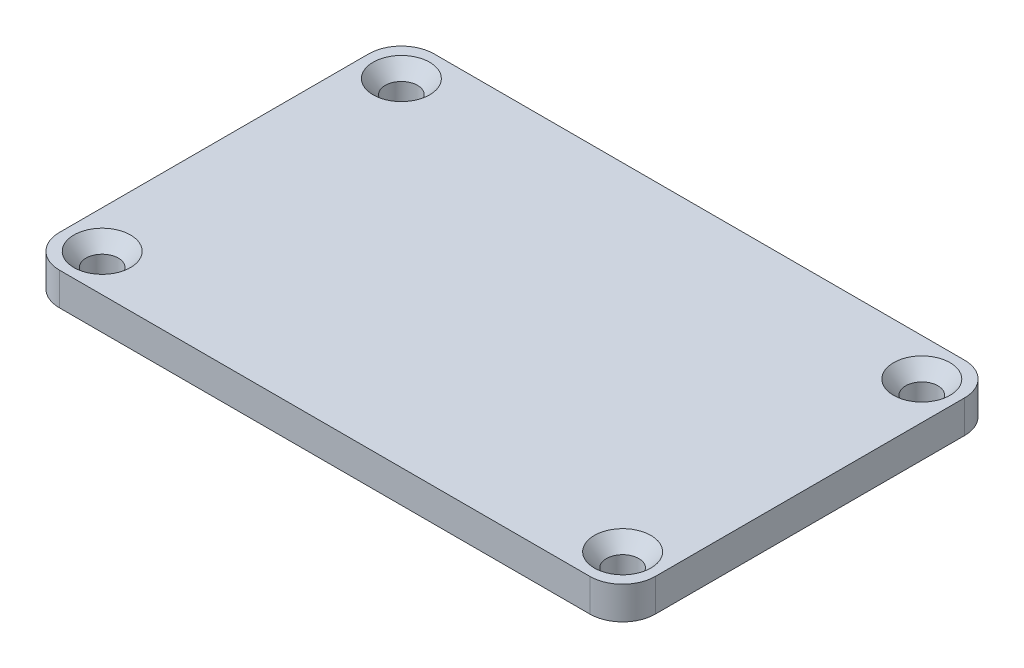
ISO-10303-21;
HEADER;
FILE_DESCRIPTION(('STEP AP214'),'2;1');
FILE_NAME('part.step','',(''),(''),'','','');
FILE_SCHEMA(('AUTOMOTIVE_DESIGN { 1 0 10303 214 1 1 1 1 }'));
ENDSEC;
DATA;
#1=APPLICATION_CONTEXT('core data for automotive mechanical design processes');
#2=APPLICATION_PROTOCOL_DEFINITION('international standard','automotive_design',2000,#1);
#3=PRODUCT_CONTEXT('',#1,'mechanical');
#4=PRODUCT('Part','Part','',(#3));
#5=PRODUCT_RELATED_PRODUCT_CATEGORY('part','',(#4));
#6=PRODUCT_DEFINITION_FORMATION('','',#4);
#7=PRODUCT_DEFINITION_CONTEXT('part definition',#1,'design');
#8=PRODUCT_DEFINITION('design','',#6,#7);
#9=PRODUCT_DEFINITION_SHAPE('','',#8);
#10=(LENGTH_UNIT() NAMED_UNIT(*) SI_UNIT(.MILLI.,.METRE.));
#11=(NAMED_UNIT(*) PLANE_ANGLE_UNIT() SI_UNIT($,.RADIAN.));
#12=(NAMED_UNIT(*) SI_UNIT($,.STERADIAN.) SOLID_ANGLE_UNIT());
#13=UNCERTAINTY_MEASURE_WITH_UNIT(LENGTH_MEASURE(1.E-05),#10,'distance_accuracy_value','');
#14=(GEOMETRIC_REPRESENTATION_CONTEXT(3) GLOBAL_UNCERTAINTY_ASSIGNED_CONTEXT((#13)) GLOBAL_UNIT_ASSIGNED_CONTEXT((#10,
#11,#12)) REPRESENTATION_CONTEXT('',''));
#15=CARTESIAN_POINT('',(0.,0.,0.));
#16=DIRECTION('',(0.,0.,1.));
#17=DIRECTION('',(1.,0.,0.));
#18=AXIS2_PLACEMENT_3D('',#15,#16,#17);
#19=CARTESIAN_POINT('',(-30.099,3.302,-18.923));
#20=DIRECTION('',(0.,0.,-1.));
#21=DIRECTION('',(-1.,0.,0.));
#22=AXIS2_PLACEMENT_3D('',#19,#20,#21);
#23=PLANE('',#22);
#24=DIRECTION('',(1.,0.,0.));
#25=VECTOR('',#24,1.);
#26=CARTESIAN_POINT('',(-30.099,0.,-18.923));
#27=LINE('',#26,#25);
#28=CARTESIAN_POINT('',(-26.797,0.,-18.923));
#29=VERTEX_POINT('',#28);
#30=CARTESIAN_POINT('',(26.797,0.,-18.923));
#31=VERTEX_POINT('',#30);
#32=EDGE_CURVE('E185',#29,#31,#27,.T.);
#33=ORIENTED_EDGE('',*,*,#32,.F.);
#34=DIRECTION('',(0.,-1.,0.));
#35=VECTOR('',#34,1.);
#36=CARTESIAN_POINT('',(-26.797,3.302,-18.923));
#37=LINE('',#36,#35);
#38=CARTESIAN_POINT('',(-26.797,3.302,-18.923));
#39=VERTEX_POINT('',#38);
#40=EDGE_CURVE('E155',#29,#39,#37,.F.);
#41=ORIENTED_EDGE('',*,*,#40,.T.);
#42=DIRECTION('',(1.,0.,0.));
#43=VECTOR('',#42,1.);
#44=CARTESIAN_POINT('',(-30.099,3.302,-18.923));
#45=LINE('',#44,#43);
#46=CARTESIAN_POINT('',(26.797,3.302,-18.923));
#47=VERTEX_POINT('',#46);
#48=EDGE_CURVE('E129',#39,#47,#45,.T.);
#49=ORIENTED_EDGE('',*,*,#48,.T.);
#50=DIRECTION('',(0.,-1.,0.));
#51=VECTOR('',#50,1.);
#52=CARTESIAN_POINT('',(26.797,0.,-18.923));
#53=LINE('',#52,#51);
#54=EDGE_CURVE('E151',#47,#31,#53,.T.);
#55=ORIENTED_EDGE('',*,*,#54,.T.);
#56=EDGE_LOOP('',(#33,#41,#49,#55));
#57=FACE_BOUND('',#56,.T.);
#58=ADVANCED_FACE('F39',(#57),#23,.T.);
#59=CARTESIAN_POINT('',(-30.099,3.302,18.923));
#60=DIRECTION('',(-1.,0.,0.));
#61=DIRECTION('',(0.,0.,1.));
#62=AXIS2_PLACEMENT_3D('',#59,#60,#61);
#63=PLANE('',#62);
#64=DIRECTION('',(0.,0.,-1.));
#65=VECTOR('',#64,1.);
#66=CARTESIAN_POINT('',(-30.099,3.302,18.923));
#67=LINE('',#66,#65);
#68=CARTESIAN_POINT('',(-30.099,3.302,15.621));
#69=VERTEX_POINT('',#68);
#70=CARTESIAN_POINT('',(-30.099,3.302,-15.621));
#71=VERTEX_POINT('',#70);
#72=EDGE_CURVE('E135',#69,#71,#67,.T.);
#73=ORIENTED_EDGE('',*,*,#72,.T.);
#74=DIRECTION('',(0.,-1.,0.));
#75=VECTOR('',#74,1.);
#76=CARTESIAN_POINT('',(-30.099,3.302,-15.621));
#77=LINE('',#76,#75);
#78=CARTESIAN_POINT('',(-30.099,0.,-15.621));
#79=VERTEX_POINT('',#78);
#80=EDGE_CURVE('E127',#71,#79,#77,.T.);
#81=ORIENTED_EDGE('',*,*,#80,.T.);
#82=DIRECTION('',(0.,0.,-1.));
#83=VECTOR('',#82,1.);
#84=CARTESIAN_POINT('',(-30.099,0.,18.923));
#85=LINE('',#84,#83);
#86=CARTESIAN_POINT('',(-30.099,0.,15.621));
#87=VERTEX_POINT('',#86);
#88=EDGE_CURVE('E109',#87,#79,#85,.T.);
#89=ORIENTED_EDGE('',*,*,#88,.F.);
#90=DIRECTION('',(0.,-1.,0.));
#91=VECTOR('',#90,1.);
#92=CARTESIAN_POINT('',(-30.099,3.302,15.621));
#93=LINE('',#92,#91);
#94=EDGE_CURVE('E124',#87,#69,#93,.F.);
#95=ORIENTED_EDGE('',*,*,#94,.T.);
#96=EDGE_LOOP('',(#73,#81,#89,#95));
#97=FACE_BOUND('',#96,.T.);
#98=ADVANCED_FACE('F123',(#97),#63,.T.);
#99=CARTESIAN_POINT('',(-30.099,3.302,18.923));
#100=DIRECTION('',(0.,0.,-1.));
#101=DIRECTION('',(-1.,0.,0.));
#102=AXIS2_PLACEMENT_3D('',#99,#100,#101);
#103=PLANE('',#102);
#104=DIRECTION('',(1.,0.,0.));
#105=VECTOR('',#104,1.);
#106=CARTESIAN_POINT('',(-30.099,3.302,18.923));
#107=LINE('',#106,#105);
#108=CARTESIAN_POINT('',(-26.797,3.302,18.923));
#109=VERTEX_POINT('',#108);
#110=CARTESIAN_POINT('',(26.797,3.302,18.923));
#111=VERTEX_POINT('',#110);
#112=EDGE_CURVE('E141',#109,#111,#107,.T.);
#113=ORIENTED_EDGE('',*,*,#112,.F.);
#114=DIRECTION('',(0.,-1.,0.));
#115=VECTOR('',#114,1.);
#116=CARTESIAN_POINT('',(-26.797,0.,18.923));
#117=LINE('',#116,#115);
#118=CARTESIAN_POINT('',(-26.797,0.,18.923));
#119=VERTEX_POINT('',#118);
#120=EDGE_CURVE('E171',#109,#119,#117,.T.);
#121=ORIENTED_EDGE('',*,*,#120,.T.);
#122=DIRECTION('',(1.,0.,0.));
#123=VECTOR('',#122,1.);
#124=CARTESIAN_POINT('',(-30.099,0.,18.923));
#125=LINE('',#124,#123);
#126=CARTESIAN_POINT('',(26.797,0.,18.923));
#127=VERTEX_POINT('',#126);
#128=EDGE_CURVE('E111',#119,#127,#125,.T.);
#129=ORIENTED_EDGE('',*,*,#128,.T.);
#130=DIRECTION('',(0.,-1.,0.));
#131=VECTOR('',#130,1.);
#132=CARTESIAN_POINT('',(26.797,3.302,18.923));
#133=LINE('',#132,#131);
#134=EDGE_CURVE('E168',#127,#111,#133,.F.);
#135=ORIENTED_EDGE('',*,*,#134,.T.);
#136=EDGE_LOOP('',(#113,#121,#129,#135));
#137=FACE_BOUND('',#136,.T.);
#138=ADVANCED_FACE('F176',(#137),#103,.F.);
#139=CARTESIAN_POINT('',(30.099,3.302,18.923));
#140=DIRECTION('',(-1.,0.,0.));
#141=DIRECTION('',(0.,0.,1.));
#142=AXIS2_PLACEMENT_3D('',#139,#140,#141);
#143=PLANE('',#142);
#144=DIRECTION('',(0.,0.,-1.));
#145=VECTOR('',#144,1.);
#146=CARTESIAN_POINT('',(30.099,3.302,18.923));
#147=LINE('',#146,#145);
#148=CARTESIAN_POINT('',(30.099,3.302,15.621));
#149=VERTEX_POINT('',#148);
#150=CARTESIAN_POINT('',(30.099,3.302,-15.621));
#151=VERTEX_POINT('',#150);
#152=EDGE_CURVE('E179',#149,#151,#147,.T.);
#153=ORIENTED_EDGE('',*,*,#152,.F.);
#154=DIRECTION('',(0.,-1.,0.));
#155=VECTOR('',#154,1.);
#156=CARTESIAN_POINT('',(30.099,3.302,15.621));
#157=LINE('',#156,#155);
#158=CARTESIAN_POINT('',(30.099,0.,15.621));
#159=VERTEX_POINT('',#158);
#160=EDGE_CURVE('E11',#149,#159,#157,.T.);
#161=ORIENTED_EDGE('',*,*,#160,.T.);
#162=DIRECTION('',(0.,0.,-1.));
#163=VECTOR('',#162,1.);
#164=CARTESIAN_POINT('',(30.099,0.,18.923));
#165=LINE('',#164,#163);
#166=CARTESIAN_POINT('',(30.099,0.,-15.621));
#167=VERTEX_POINT('',#166);
#168=EDGE_CURVE('E189',#159,#167,#165,.T.);
#169=ORIENTED_EDGE('',*,*,#168,.T.);
#170=DIRECTION('',(0.,-1.,0.));
#171=VECTOR('',#170,1.);
#172=CARTESIAN_POINT('',(30.099,3.302,-15.621));
#173=LINE('',#172,#171);
#174=EDGE_CURVE('E48',#167,#151,#173,.F.);
#175=ORIENTED_EDGE('',*,*,#174,.T.);
#176=EDGE_LOOP('',(#153,#161,#169,#175));
#177=FACE_BOUND('',#176,.T.);
#178=ADVANCED_FACE('F253',(#177),#143,.F.);
#179=CARTESIAN_POINT('',(0.,3.302,0.));
#180=DIRECTION('',(0.,1.,0.));
#181=DIRECTION('',(0.,0.,1.));
#182=AXIS2_PLACEMENT_3D('',#179,#180,#181);
#183=PLANE('',#182);
#184=CARTESIAN_POINT('',(-26.289,3.302,-15.113));
#185=DIRECTION('',(0.,1.,0.));
#186=DIRECTION('',(0.,0.,1.));
#187=AXIS2_PLACEMENT_3D('',#184,#185,#186);
#188=CIRCLE('',#187,2.8575);
#189=CARTESIAN_POINT('',(-26.289,3.302,-12.2555));
#190=VERTEX_POINT('',#189);
#191=EDGE_CURVE('E237',#190,#190,#188,.T.);
#192=ORIENTED_EDGE('',*,*,#191,.F.);
#193=EDGE_LOOP('',(#192));
#194=FACE_BOUND('',#193,.T.);
#195=CARTESIAN_POINT('',(26.289,3.302,-15.113));
#196=DIRECTION('',(0.,1.,0.));
#197=DIRECTION('',(0.,0.,1.));
#198=AXIS2_PLACEMENT_3D('',#195,#196,#197);
#199=CIRCLE('',#198,2.8575);
#200=CARTESIAN_POINT('',(26.289,3.302,-12.2555));
#201=VERTEX_POINT('',#200);
#202=EDGE_CURVE('E225',#201,#201,#199,.T.);
#203=ORIENTED_EDGE('',*,*,#202,.F.);
#204=EDGE_LOOP('',(#203));
#205=FACE_BOUND('',#204,.T.);
#206=CARTESIAN_POINT('',(26.289,3.302,15.113));
#207=DIRECTION('',(0.,1.,0.));
#208=DIRECTION('',(0.,0.,1.));
#209=AXIS2_PLACEMENT_3D('',#206,#207,#208);
#210=CIRCLE('',#209,2.8575);
#211=CARTESIAN_POINT('',(26.289,3.302,17.9705));
#212=VERTEX_POINT('',#211);
#213=EDGE_CURVE('E213',#212,#212,#210,.T.);
#214=ORIENTED_EDGE('',*,*,#213,.F.);
#215=EDGE_LOOP('',(#214));
#216=FACE_BOUND('',#215,.T.);
#217=CARTESIAN_POINT('',(-26.289,3.302,15.113));
#218=DIRECTION('',(0.,1.,0.));
#219=DIRECTION('',(0.,0.,1.));
#220=AXIS2_PLACEMENT_3D('',#217,#218,#219);
#221=CIRCLE('',#220,2.8575);
#222=CARTESIAN_POINT('',(-26.289,3.302,17.9705));
#223=VERTEX_POINT('',#222);
#224=EDGE_CURVE('E201',#223,#223,#221,.T.);
#225=ORIENTED_EDGE('',*,*,#224,.F.);
#226=EDGE_LOOP('',(#225));
#227=FACE_BOUND('',#226,.T.);
#228=ORIENTED_EDGE('',*,*,#48,.F.);
#229=CARTESIAN_POINT('',(-26.797,3.302,-15.621));
#230=DIRECTION('',(0.,1.,0.));
#231=DIRECTION('',(0.,0.,1.));
#232=AXIS2_PLACEMENT_3D('',#229,#230,#231);
#233=CIRCLE('',#232,3.302);
#234=EDGE_CURVE('E165',#39,#71,#233,.T.);
#235=ORIENTED_EDGE('',*,*,#234,.T.);
#236=ORIENTED_EDGE('',*,*,#72,.F.);
#237=CARTESIAN_POINT('',(-26.797,3.302,15.621));
#238=DIRECTION('',(0.,1.,0.));
#239=DIRECTION('',(0.,0.,1.));
#240=AXIS2_PLACEMENT_3D('',#237,#238,#239);
#241=CIRCLE('',#240,3.302);
#242=EDGE_CURVE('E133',#69,#109,#241,.T.);
#243=ORIENTED_EDGE('',*,*,#242,.T.);
#244=ORIENTED_EDGE('',*,*,#112,.T.);
#245=CARTESIAN_POINT('',(26.797,3.302,15.621));
#246=DIRECTION('',(0.,1.,0.));
#247=DIRECTION('',(0.,0.,1.));
#248=AXIS2_PLACEMENT_3D('',#245,#246,#247);
#249=CIRCLE('',#248,3.302);
#250=EDGE_CURVE('E61',#111,#149,#249,.T.);
#251=ORIENTED_EDGE('',*,*,#250,.T.);
#252=ORIENTED_EDGE('',*,*,#152,.T.);
#253=CARTESIAN_POINT('',(26.797,3.302,-15.621));
#254=DIRECTION('',(0.,1.,0.));
#255=DIRECTION('',(0.,0.,1.));
#256=AXIS2_PLACEMENT_3D('',#253,#254,#255);
#257=CIRCLE('',#256,3.302);
#258=EDGE_CURVE('E158',#151,#47,#257,.T.);
#259=ORIENTED_EDGE('',*,*,#258,.T.);
#260=EDGE_LOOP('',(#228,#235,#236,#243,#244,#251,#252,#259));
#261=FACE_BOUND('',#260,.T.);
#262=ADVANCED_FACE('F279',(#194,#205,#216,#227,#261),#183,.T.);
#263=CARTESIAN_POINT('',(0.,0.,0.));
#264=DIRECTION('',(0.,1.,0.));
#265=DIRECTION('',(0.,0.,1.));
#266=AXIS2_PLACEMENT_3D('',#263,#264,#265);
#267=PLANE('',#266);
#268=CARTESIAN_POINT('',(-26.289,0.,-15.113));
#269=DIRECTION('',(0.,1.,0.));
#270=DIRECTION('',(0.,0.,1.));
#271=AXIS2_PLACEMENT_3D('',#268,#269,#270);
#272=CIRCLE('',#271,1.63195);
#273=CARTESIAN_POINT('',(-26.289,0.,-13.48105));
#274=VERTEX_POINT('',#273);
#275=EDGE_CURVE('E229',#274,#274,#272,.T.);
#276=ORIENTED_EDGE('',*,*,#275,.T.);
#277=EDGE_LOOP('',(#276));
#278=FACE_BOUND('',#277,.T.);
#279=CARTESIAN_POINT('',(26.289,0.,-15.113));
#280=DIRECTION('',(0.,1.,0.));
#281=DIRECTION('',(0.,0.,1.));
#282=AXIS2_PLACEMENT_3D('',#279,#280,#281);
#283=CIRCLE('',#282,1.63195);
#284=CARTESIAN_POINT('',(26.289,0.,-13.48105));
#285=VERTEX_POINT('',#284);
#286=EDGE_CURVE('E217',#285,#285,#283,.T.);
#287=ORIENTED_EDGE('',*,*,#286,.T.);
#288=EDGE_LOOP('',(#287));
#289=FACE_BOUND('',#288,.T.);
#290=CARTESIAN_POINT('',(26.289,0.,15.113));
#291=DIRECTION('',(0.,1.,0.));
#292=DIRECTION('',(0.,0.,1.));
#293=AXIS2_PLACEMENT_3D('',#290,#291,#292);
#294=CIRCLE('',#293,1.63195);
#295=CARTESIAN_POINT('',(26.289,0.,16.74495));
#296=VERTEX_POINT('',#295);
#297=EDGE_CURVE('E205',#296,#296,#294,.T.);
#298=ORIENTED_EDGE('',*,*,#297,.T.);
#299=EDGE_LOOP('',(#298));
#300=FACE_BOUND('',#299,.T.);
#301=CARTESIAN_POINT('',(-26.289,0.,15.113));
#302=DIRECTION('',(0.,1.,0.));
#303=DIRECTION('',(0.,0.,1.));
#304=AXIS2_PLACEMENT_3D('',#301,#302,#303);
#305=CIRCLE('',#304,1.63195);
#306=CARTESIAN_POINT('',(-26.289,0.,16.74495));
#307=VERTEX_POINT('',#306);
#308=EDGE_CURVE('E190',#307,#307,#305,.T.);
#309=ORIENTED_EDGE('',*,*,#308,.T.);
#310=EDGE_LOOP('',(#309));
#311=FACE_BOUND('',#310,.T.);
#312=ORIENTED_EDGE('',*,*,#88,.T.);
#313=CARTESIAN_POINT('',(-26.797,0.,-15.621));
#314=DIRECTION('',(0.,1.,0.));
#315=DIRECTION('',(0.,0.,1.));
#316=AXIS2_PLACEMENT_3D('',#313,#314,#315);
#317=CIRCLE('',#316,3.302);
#318=EDGE_CURVE('E117',#79,#29,#317,.F.);
#319=ORIENTED_EDGE('',*,*,#318,.T.);
#320=ORIENTED_EDGE('',*,*,#32,.T.);
#321=CARTESIAN_POINT('',(26.797,0.,-15.621));
#322=DIRECTION('',(0.,1.,0.));
#323=DIRECTION('',(0.,0.,1.));
#324=AXIS2_PLACEMENT_3D('',#321,#322,#323);
#325=CIRCLE('',#324,3.302);
#326=EDGE_CURVE('E139',#31,#167,#325,.F.);
#327=ORIENTED_EDGE('',*,*,#326,.T.);
#328=ORIENTED_EDGE('',*,*,#168,.F.);
#329=CARTESIAN_POINT('',(26.797,0.,15.621));
#330=DIRECTION('',(0.,1.,0.));
#331=DIRECTION('',(0.,0.,1.));
#332=AXIS2_PLACEMENT_3D('',#329,#330,#331);
#333=CIRCLE('',#332,3.302);
#334=EDGE_CURVE('E118',#159,#127,#333,.F.);
#335=ORIENTED_EDGE('',*,*,#334,.T.);
#336=ORIENTED_EDGE('',*,*,#128,.F.);
#337=CARTESIAN_POINT('',(-26.797,0.,15.621));
#338=DIRECTION('',(0.,1.,0.));
#339=DIRECTION('',(0.,0.,1.));
#340=AXIS2_PLACEMENT_3D('',#337,#338,#339);
#341=CIRCLE('',#340,3.302);
#342=EDGE_CURVE('E106',#119,#87,#341,.F.);
#343=ORIENTED_EDGE('',*,*,#342,.T.);
#344=EDGE_LOOP('',(#312,#319,#320,#327,#328,#335,#336,#343));
#345=FACE_BOUND('',#344,.T.);
#346=ADVANCED_FACE('F108',(#278,#289,#300,#311,#345),#267,.F.);
#347=CARTESIAN_POINT('',(-26.797,3.302,-15.621));
#348=DIRECTION('',(0.,-1.,0.));
#349=DIRECTION('',(0.,0.,-1.));
#350=AXIS2_PLACEMENT_3D('',#347,#348,#349);
#351=CYLINDRICAL_SURFACE('',#350,3.302);
#352=ORIENTED_EDGE('',*,*,#234,.F.);
#353=ORIENTED_EDGE('',*,*,#40,.F.);
#354=ORIENTED_EDGE('',*,*,#318,.F.);
#355=ORIENTED_EDGE('',*,*,#80,.F.);
#356=EDGE_LOOP('',(#352,#353,#354,#355));
#357=FACE_BOUND('',#356,.T.);
#358=ADVANCED_FACE('F263',(#357),#351,.T.);
#359=CARTESIAN_POINT('',(-26.797,3.302,15.621));
#360=DIRECTION('',(0.,1.,0.));
#361=DIRECTION('',(0.,0.,1.));
#362=AXIS2_PLACEMENT_3D('',#359,#360,#361);
#363=CYLINDRICAL_SURFACE('',#362,3.302);
#364=ORIENTED_EDGE('',*,*,#242,.F.);
#365=ORIENTED_EDGE('',*,*,#94,.F.);
#366=ORIENTED_EDGE('',*,*,#342,.F.);
#367=ORIENTED_EDGE('',*,*,#120,.F.);
#368=EDGE_LOOP('',(#364,#365,#366,#367));
#369=FACE_BOUND('',#368,.T.);
#370=ADVANCED_FACE('F132',(#369),#363,.T.);
#371=CARTESIAN_POINT('',(26.797,3.302,15.621));
#372=DIRECTION('',(0.,-1.,0.));
#373=DIRECTION('',(0.,0.,-1.));
#374=AXIS2_PLACEMENT_3D('',#371,#372,#373);
#375=CYLINDRICAL_SURFACE('',#374,3.302);
#376=ORIENTED_EDGE('',*,*,#250,.F.);
#377=ORIENTED_EDGE('',*,*,#134,.F.);
#378=ORIENTED_EDGE('',*,*,#334,.F.);
#379=ORIENTED_EDGE('',*,*,#160,.F.);
#380=EDGE_LOOP('',(#376,#377,#378,#379));
#381=FACE_BOUND('',#380,.T.);
#382=ADVANCED_FACE('F256',(#381),#375,.T.);
#383=CARTESIAN_POINT('',(26.797,3.302,-15.621));
#384=DIRECTION('',(0.,1.,0.));
#385=DIRECTION('',(0.,0.,1.));
#386=AXIS2_PLACEMENT_3D('',#383,#384,#385);
#387=CYLINDRICAL_SURFACE('',#386,3.302);
#388=ORIENTED_EDGE('',*,*,#258,.F.);
#389=ORIENTED_EDGE('',*,*,#174,.F.);
#390=ORIENTED_EDGE('',*,*,#326,.F.);
#391=ORIENTED_EDGE('',*,*,#54,.F.);
#392=EDGE_LOOP('',(#388,#389,#390,#391));
#393=FACE_BOUND('',#392,.T.);
#394=ADVANCED_FACE('F41',(#393),#387,.T.);
#395=CARTESIAN_POINT('',(-26.289,3.302,15.113));
#396=DIRECTION('',(0.,1.,0.));
#397=DIRECTION('',(0.,0.,1.));
#398=AXIS2_PLACEMENT_3D('',#395,#396,#397);
#399=CYLINDRICAL_SURFACE('',#398,1.63195);
#400=ORIENTED_EDGE('',*,*,#308,.F.);
#401=EDGE_LOOP('',(#400));
#402=FACE_BOUND('',#401,.T.);
#403=CARTESIAN_POINT('',(-26.289,1.89216599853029,15.113));
#404=DIRECTION('',(0.,1.,0.));
#405=DIRECTION('',(0.,0.,1.));
#406=AXIS2_PLACEMENT_3D('',#403,#404,#405);
#407=CIRCLE('',#406,1.63195);
#408=CARTESIAN_POINT('',(-26.289,1.89216599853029,16.74495));
#409=VERTEX_POINT('',#408);
#410=EDGE_CURVE('E197',#409,#409,#407,.T.);
#411=ORIENTED_EDGE('',*,*,#410,.T.);
#412=EDGE_LOOP('',(#411));
#413=FACE_BOUND('',#412,.T.);
#414=ADVANCED_FACE('F262',(#402,#413),#399,.F.);
#415=CARTESIAN_POINT('',(-26.289,3.302,15.113));
#416=DIRECTION('',(0.,1.,0.));
#417=DIRECTION('',(0.,0.,1.));
#418=AXIS2_PLACEMENT_3D('',#415,#416,#417);
#419=CONICAL_SURFACE('',#418,2.8575,0.715584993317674);
#420=ORIENTED_EDGE('',*,*,#410,.F.);
#421=EDGE_LOOP('',(#420));
#422=FACE_BOUND('',#421,.T.);
#423=ORIENTED_EDGE('',*,*,#224,.T.);
#424=EDGE_LOOP('',(#423));
#425=FACE_BOUND('',#424,.T.);
#426=ADVANCED_FACE('F339',(#422,#425),#419,.F.);
#427=CARTESIAN_POINT('',(26.289,3.302,15.113));
#428=DIRECTION('',(0.,1.,0.));
#429=DIRECTION('',(0.,0.,1.));
#430=AXIS2_PLACEMENT_3D('',#427,#428,#429);
#431=CYLINDRICAL_SURFACE('',#430,1.63195);
#432=ORIENTED_EDGE('',*,*,#297,.F.);
#433=EDGE_LOOP('',(#432));
#434=FACE_BOUND('',#433,.T.);
#435=CARTESIAN_POINT('',(26.289,1.89216599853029,15.113));
#436=DIRECTION('',(0.,1.,0.));
#437=DIRECTION('',(0.,0.,1.));
#438=AXIS2_PLACEMENT_3D('',#435,#436,#437);
#439=CIRCLE('',#438,1.63195);
#440=CARTESIAN_POINT('',(26.289,1.89216599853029,16.74495));
#441=VERTEX_POINT('',#440);
#442=EDGE_CURVE('E209',#441,#441,#439,.T.);
#443=ORIENTED_EDGE('',*,*,#442,.T.);
#444=EDGE_LOOP('',(#443));
#445=FACE_BOUND('',#444,.T.);
#446=ADVANCED_FACE('F348',(#434,#445),#431,.F.);
#447=CARTESIAN_POINT('',(26.289,3.302,15.113));
#448=DIRECTION('',(0.,1.,0.));
#449=DIRECTION('',(0.,0.,1.));
#450=AXIS2_PLACEMENT_3D('',#447,#448,#449);
#451=CONICAL_SURFACE('',#450,2.8575,0.715584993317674);
#452=ORIENTED_EDGE('',*,*,#442,.F.);
#453=EDGE_LOOP('',(#452));
#454=FACE_BOUND('',#453,.T.);
#455=ORIENTED_EDGE('',*,*,#213,.T.);
#456=EDGE_LOOP('',(#455));
#457=FACE_BOUND('',#456,.T.);
#458=ADVANCED_FACE('F357',(#454,#457),#451,.F.);
#459=CARTESIAN_POINT('',(26.289,3.302,-15.113));
#460=DIRECTION('',(0.,1.,0.));
#461=DIRECTION('',(0.,0.,1.));
#462=AXIS2_PLACEMENT_3D('',#459,#460,#461);
#463=CYLINDRICAL_SURFACE('',#462,1.63195);
#464=ORIENTED_EDGE('',*,*,#286,.F.);
#465=EDGE_LOOP('',(#464));
#466=FACE_BOUND('',#465,.T.);
#467=CARTESIAN_POINT('',(26.289,1.89216599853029,-15.113));
#468=DIRECTION('',(0.,1.,0.));
#469=DIRECTION('',(0.,0.,1.));
#470=AXIS2_PLACEMENT_3D('',#467,#468,#469);
#471=CIRCLE('',#470,1.63195);
#472=CARTESIAN_POINT('',(26.289,1.89216599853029,-13.48105));
#473=VERTEX_POINT('',#472);
#474=EDGE_CURVE('E221',#473,#473,#471,.T.);
#475=ORIENTED_EDGE('',*,*,#474,.T.);
#476=EDGE_LOOP('',(#475));
#477=FACE_BOUND('',#476,.T.);
#478=ADVANCED_FACE('F367',(#466,#477),#463,.F.);
#479=CARTESIAN_POINT('',(26.289,3.302,-15.113));
#480=DIRECTION('',(0.,1.,0.));
#481=DIRECTION('',(0.,0.,1.));
#482=AXIS2_PLACEMENT_3D('',#479,#480,#481);
#483=CONICAL_SURFACE('',#482,2.8575,0.715584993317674);
#484=ORIENTED_EDGE('',*,*,#474,.F.);
#485=EDGE_LOOP('',(#484));
#486=FACE_BOUND('',#485,.T.);
#487=ORIENTED_EDGE('',*,*,#202,.T.);
#488=EDGE_LOOP('',(#487));
#489=FACE_BOUND('',#488,.T.);
#490=ADVANCED_FACE('F377',(#486,#489),#483,.F.);
#491=CARTESIAN_POINT('',(-26.289,3.302,-15.113));
#492=DIRECTION('',(0.,1.,0.));
#493=DIRECTION('',(0.,0.,1.));
#494=AXIS2_PLACEMENT_3D('',#491,#492,#493);
#495=CYLINDRICAL_SURFACE('',#494,1.63195);
#496=ORIENTED_EDGE('',*,*,#275,.F.);
#497=EDGE_LOOP('',(#496));
#498=FACE_BOUND('',#497,.T.);
#499=CARTESIAN_POINT('',(-26.289,1.89216599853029,-15.113));
#500=DIRECTION('',(0.,1.,0.));
#501=DIRECTION('',(0.,0.,1.));
#502=AXIS2_PLACEMENT_3D('',#499,#500,#501);
#503=CIRCLE('',#502,1.63195);
#504=CARTESIAN_POINT('',(-26.289,1.89216599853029,-13.48105));
#505=VERTEX_POINT('',#504);
#506=EDGE_CURVE('E233',#505,#505,#503,.T.);
#507=ORIENTED_EDGE('',*,*,#506,.T.);
#508=EDGE_LOOP('',(#507));
#509=FACE_BOUND('',#508,.T.);
#510=ADVANCED_FACE('F387',(#498,#509),#495,.F.);
#511=CARTESIAN_POINT('',(-26.289,3.302,-15.113));
#512=DIRECTION('',(0.,1.,0.));
#513=DIRECTION('',(0.,0.,1.));
#514=AXIS2_PLACEMENT_3D('',#511,#512,#513);
#515=CONICAL_SURFACE('',#514,2.8575,0.715584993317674);
#516=ORIENTED_EDGE('',*,*,#506,.F.);
#517=EDGE_LOOP('',(#516));
#518=FACE_BOUND('',#517,.T.);
#519=ORIENTED_EDGE('',*,*,#191,.T.);
#520=EDGE_LOOP('',(#519));
#521=FACE_BOUND('',#520,.T.);
#522=ADVANCED_FACE('F397',(#518,#521),#515,.F.);
#523=CLOSED_SHELL('',(#58,#98,#138,#178,#262,#346,#358,#370,#382,#394,#414,#426,#446,#458,#478,
#490,#510,#522));
#524=MANIFOLD_SOLID_BREP('B2',#523);
#525=ADVANCED_BREP_SHAPE_REPRESENTATION('',(#18,#524),#14);
#526=SHAPE_DEFINITION_REPRESENTATION(#9,#525);
ENDSEC;
END-ISO-10303-21;
